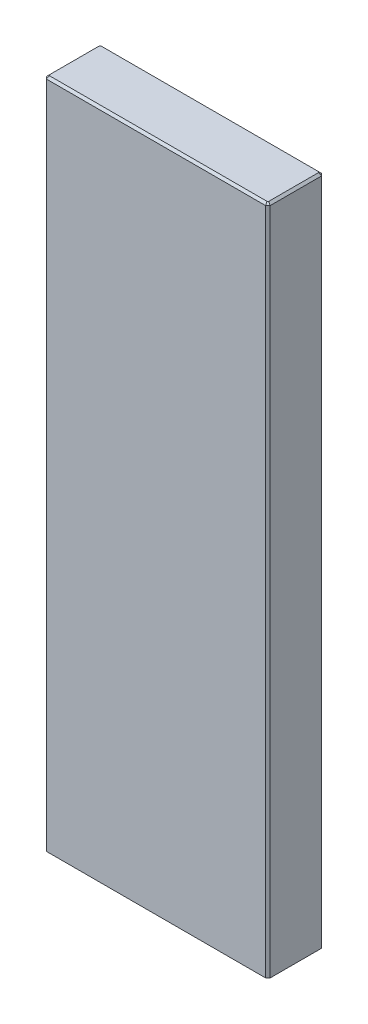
ISO-10303-21;
HEADER;
FILE_DESCRIPTION(('STEP AP214'),'2;1');
FILE_NAME('part.step','',(''),(''),'','','');
FILE_SCHEMA(('AUTOMOTIVE_DESIGN { 1 0 10303 214 1 1 1 1 }'));
ENDSEC;
DATA;
#1=APPLICATION_CONTEXT('core data for automotive mechanical design processes');
#2=APPLICATION_PROTOCOL_DEFINITION('international standard','automotive_design',2000,#1);
#3=PRODUCT_CONTEXT('',#1,'mechanical');
#4=PRODUCT('Part','Part','',(#3));
#5=PRODUCT_RELATED_PRODUCT_CATEGORY('part','',(#4));
#6=PRODUCT_DEFINITION_FORMATION('','',#4);
#7=PRODUCT_DEFINITION_CONTEXT('part definition',#1,'design');
#8=PRODUCT_DEFINITION('design','',#6,#7);
#9=PRODUCT_DEFINITION_SHAPE('','',#8);
#10=(LENGTH_UNIT() NAMED_UNIT(*) SI_UNIT(.MILLI.,.METRE.));
#11=(NAMED_UNIT(*) PLANE_ANGLE_UNIT() SI_UNIT($,.RADIAN.));
#12=(NAMED_UNIT(*) SI_UNIT($,.STERADIAN.) SOLID_ANGLE_UNIT());
#13=UNCERTAINTY_MEASURE_WITH_UNIT(LENGTH_MEASURE(1.E-05),#10,'distance_accuracy_value','');
#14=(GEOMETRIC_REPRESENTATION_CONTEXT(3) GLOBAL_UNCERTAINTY_ASSIGNED_CONTEXT((#13)) GLOBAL_UNIT_ASSIGNED_CONTEXT((#10,
#11,#12)) REPRESENTATION_CONTEXT('',''));
#15=CARTESIAN_POINT('',(0.,0.,0.));
#16=DIRECTION('',(0.,0.,1.));
#17=DIRECTION('',(1.,0.,0.));
#18=AXIS2_PLACEMENT_3D('',#15,#16,#17);
#19=CARTESIAN_POINT('',(-25.4,152.4,12.7));
#20=DIRECTION('',(1.,0.,0.));
#21=DIRECTION('',(0.,1.,0.));
#22=AXIS2_PLACEMENT_3D('',#19,#20,#21);
#23=PLANE('',#22);
#24=DIRECTION('',(0.,1.,0.));
#25=VECTOR('',#24,1.);
#26=CARTESIAN_POINT('',(-25.4,152.4,12.2));
#27=LINE('',#26,#25);
#28=CARTESIAN_POINT('',(-25.4,0.,12.2));
#29=VERTEX_POINT('',#28);
#30=CARTESIAN_POINT('',(-25.4,151.9,12.2));
#31=VERTEX_POINT('',#30);
#32=EDGE_CURVE('E173',#29,#31,#27,.T.);
#33=ORIENTED_EDGE('',*,*,#32,.T.);
#34=DIRECTION('',(0.,0.,-1.));
#35=VECTOR('',#34,1.);
#36=CARTESIAN_POINT('',(-25.4,151.9,12.7));
#37=LINE('',#36,#35);
#38=CARTESIAN_POINT('',(-25.4,151.9,0.5));
#39=VERTEX_POINT('',#38);
#40=EDGE_CURVE('E202',#31,#39,#37,.T.);
#41=ORIENTED_EDGE('',*,*,#40,.T.);
#42=DIRECTION('',(0.,-1.,0.));
#43=VECTOR('',#42,1.);
#44=CARTESIAN_POINT('',(-25.4,152.4,0.5));
#45=LINE('',#44,#43);
#46=CARTESIAN_POINT('',(-25.4,0.,0.500000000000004));
#47=VERTEX_POINT('',#46);
#48=EDGE_CURVE('E176',#39,#47,#45,.T.);
#49=ORIENTED_EDGE('',*,*,#48,.T.);
#50=DIRECTION('',(0.,0.,-1.));
#51=VECTOR('',#50,1.);
#52=CARTESIAN_POINT('',(-25.4,0.,12.7));
#53=LINE('',#52,#51);
#54=EDGE_CURVE('E149',#29,#47,#53,.T.);
#55=ORIENTED_EDGE('',*,*,#54,.F.);
#56=EDGE_LOOP('',(#33,#41,#49,#55));
#57=FACE_BOUND('',#56,.T.);
#58=ADVANCED_FACE('F31',(#57),#23,.F.);
#59=CARTESIAN_POINT('',(-25.4,0.,12.7));
#60=DIRECTION('',(0.,1.,0.));
#61=DIRECTION('',(0.,0.,1.));
#62=AXIS2_PLACEMENT_3D('',#59,#60,#61);
#63=PLANE('',#62);
#64=CARTESIAN_POINT('',(14.0875,0.,6.35));
#65=DIRECTION('',(0.,-1.,0.));
#66=DIRECTION('',(0.,0.,-1.));
#67=AXIS2_PLACEMENT_3D('',#64,#65,#66);
#68=CIRCLE('',#67,3.048);
#69=CARTESIAN_POINT('',(14.0875,0.,3.302));
#70=VERTEX_POINT('',#69);
#71=EDGE_CURVE('E229',#70,#70,#68,.T.);
#72=ORIENTED_EDGE('',*,*,#71,.F.);
#73=EDGE_LOOP('',(#72));
#74=FACE_BOUND('',#73,.T.);
#75=DIRECTION('',(1.,0.,0.));
#76=VECTOR('',#75,1.);
#77=CARTESIAN_POINT('',(-25.4,0.,0.));
#78=LINE('',#77,#76);
#79=CARTESIAN_POINT('',(-24.9,0.,0.));
#80=VERTEX_POINT('',#79);
#81=CARTESIAN_POINT('',(24.9,0.,0.));
#82=VERTEX_POINT('',#81);
#83=EDGE_CURVE('E133',#80,#82,#78,.T.);
#84=ORIENTED_EDGE('',*,*,#83,.T.);
#85=DIRECTION('',(-0.707106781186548,0.,-0.707106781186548));
#86=VECTOR('',#85,1.);
#87=CARTESIAN_POINT('',(25.4,0.,0.499999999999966));
#88=LINE('',#87,#86);
#89=CARTESIAN_POINT('',(25.4,0.,0.499999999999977));
#90=VERTEX_POINT('',#89);
#91=EDGE_CURVE('E166',#82,#90,#88,.F.);
#92=ORIENTED_EDGE('',*,*,#91,.T.);
#93=DIRECTION('',(0.,0.,-1.));
#94=VECTOR('',#93,1.);
#95=CARTESIAN_POINT('',(25.4,0.,12.7));
#96=LINE('',#95,#94);
#97=CARTESIAN_POINT('',(25.4,0.,12.2));
#98=VERTEX_POINT('',#97);
#99=EDGE_CURVE('E145',#98,#90,#96,.T.);
#100=ORIENTED_EDGE('',*,*,#99,.F.);
#101=DIRECTION('',(-0.707106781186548,0.,0.707106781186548));
#102=VECTOR('',#101,1.);
#103=CARTESIAN_POINT('',(24.9,0.,12.7));
#104=LINE('',#103,#102);
#105=CARTESIAN_POINT('',(24.9,0.,12.7));
#106=VERTEX_POINT('',#105);
#107=EDGE_CURVE('E164',#98,#106,#104,.T.);
#108=ORIENTED_EDGE('',*,*,#107,.T.);
#109=DIRECTION('',(1.,0.,0.));
#110=VECTOR('',#109,1.);
#111=CARTESIAN_POINT('',(-25.4,0.,12.7));
#112=LINE('',#111,#110);
#113=CARTESIAN_POINT('',(-24.9,0.,12.7));
#114=VERTEX_POINT('',#113);
#115=EDGE_CURVE('E137',#114,#106,#112,.T.);
#116=ORIENTED_EDGE('',*,*,#115,.F.);
#117=DIRECTION('',(-0.707106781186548,0.,-0.707106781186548));
#118=VECTOR('',#117,1.);
#119=CARTESIAN_POINT('',(-24.9,0.,12.7));
#120=LINE('',#119,#118);
#121=EDGE_CURVE('E160',#114,#29,#120,.T.);
#122=ORIENTED_EDGE('',*,*,#121,.T.);
#123=ORIENTED_EDGE('',*,*,#54,.T.);
#124=DIRECTION('',(-0.707106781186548,0.,0.707106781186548));
#125=VECTOR('',#124,1.);
#126=CARTESIAN_POINT('',(-25.4,0.,0.499999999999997));
#127=LINE('',#126,#125);
#128=EDGE_CURVE('E162',#47,#80,#127,.F.);
#129=ORIENTED_EDGE('',*,*,#128,.T.);
#130=EDGE_LOOP('',(#84,#92,#100,#108,#116,#122,#123,#129));
#131=FACE_BOUND('',#130,.T.);
#132=ADVANCED_FACE('F263',(#74,#131),#63,.F.);
#133=CARTESIAN_POINT('',(25.4,152.4,12.7));
#134=DIRECTION('',(-1.,0.,0.));
#135=DIRECTION('',(0.,-1.,0.));
#136=AXIS2_PLACEMENT_3D('',#133,#134,#135);
#137=PLANE('',#136);
#138=DIRECTION('',(0.,1.,0.));
#139=VECTOR('',#138,1.);
#140=CARTESIAN_POINT('',(25.4,152.4,0.499999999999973));
#141=LINE('',#140,#139);
#142=CARTESIAN_POINT('',(25.4,151.9,0.499999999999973));
#143=VERTEX_POINT('',#142);
#144=EDGE_CURVE('E154',#90,#143,#141,.T.);
#145=ORIENTED_EDGE('',*,*,#144,.T.);
#146=DIRECTION('',(0.,0.,1.));
#147=VECTOR('',#146,1.);
#148=CARTESIAN_POINT('',(25.4,151.9,12.7));
#149=LINE('',#148,#147);
#150=CARTESIAN_POINT('',(25.4,151.9,12.2));
#151=VERTEX_POINT('',#150);
#152=EDGE_CURVE('E11',#143,#151,#149,.T.);
#153=ORIENTED_EDGE('',*,*,#152,.T.);
#154=DIRECTION('',(0.,-1.,0.));
#155=VECTOR('',#154,1.);
#156=CARTESIAN_POINT('',(25.4,0.,12.2));
#157=LINE('',#156,#155);
#158=EDGE_CURVE('E152',#151,#98,#157,.T.);
#159=ORIENTED_EDGE('',*,*,#158,.T.);
#160=ORIENTED_EDGE('',*,*,#99,.T.);
#161=EDGE_LOOP('',(#145,#153,#159,#160));
#162=FACE_BOUND('',#161,.T.);
#163=ADVANCED_FACE('F271',(#162),#137,.F.);
#164=CARTESIAN_POINT('',(-25.4,152.4,12.7));
#165=DIRECTION('',(0.,-1.,0.));
#166=DIRECTION('',(1.,0.,0.));
#167=AXIS2_PLACEMENT_3D('',#164,#165,#166);
#168=PLANE('',#167);
#169=DIRECTION('',(1.,0.,0.));
#170=VECTOR('',#169,1.);
#171=CARTESIAN_POINT('',(24.9,152.4,12.2));
#172=LINE('',#171,#170);
#173=CARTESIAN_POINT('',(-24.6928932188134,152.4,12.2));
#174=VERTEX_POINT('',#173);
#175=CARTESIAN_POINT('',(24.6928932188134,152.4,12.2));
#176=VERTEX_POINT('',#175);
#177=EDGE_CURVE('E190',#174,#176,#172,.T.);
#178=ORIENTED_EDGE('',*,*,#177,.T.);
#179=DIRECTION('',(0.707106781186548,0.,-0.707106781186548));
#180=VECTOR('',#179,1.);
#181=CARTESIAN_POINT('',(25.0464466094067,152.4,11.8464466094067));
#182=LINE('',#181,#180);
#183=CARTESIAN_POINT('',(24.9,152.4,11.9928932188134));
#184=VERTEX_POINT('',#183);
#185=EDGE_CURVE('E192',#176,#184,#182,.T.);
#186=ORIENTED_EDGE('',*,*,#185,.T.);
#187=DIRECTION('',(0.,0.,-1.));
#188=VECTOR('',#187,1.);
#189=CARTESIAN_POINT('',(24.9,152.4,12.7));
#190=LINE('',#189,#188);
#191=CARTESIAN_POINT('',(24.9,152.4,0.707106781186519));
#192=VERTEX_POINT('',#191);
#193=EDGE_CURVE('E178',#184,#192,#190,.T.);
#194=ORIENTED_EDGE('',*,*,#193,.T.);
#195=DIRECTION('',(-0.707106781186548,0.,-0.707106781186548));
#196=VECTOR('',#195,1.);
#197=CARTESIAN_POINT('',(24.5464466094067,152.4,0.353553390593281));
#198=LINE('',#197,#196);
#199=CARTESIAN_POINT('',(24.6928932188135,152.4,0.500000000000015));
#200=VERTEX_POINT('',#199);
#201=EDGE_CURVE('E180',#192,#200,#198,.T.);
#202=ORIENTED_EDGE('',*,*,#201,.T.);
#203=DIRECTION('',(-1.,0.,0.));
#204=VECTOR('',#203,1.);
#205=CARTESIAN_POINT('',(-25.4,152.4,0.500000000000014));
#206=LINE('',#205,#204);
#207=CARTESIAN_POINT('',(-24.6928932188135,152.4,0.500000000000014));
#208=VERTEX_POINT('',#207);
#209=EDGE_CURVE('E182',#200,#208,#206,.T.);
#210=ORIENTED_EDGE('',*,*,#209,.T.);
#211=DIRECTION('',(-0.707106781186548,0.,0.707106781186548));
#212=VECTOR('',#211,1.);
#213=CARTESIAN_POINT('',(-25.0464466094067,152.4,0.853553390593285));
#214=LINE('',#213,#212);
#215=CARTESIAN_POINT('',(-24.9,152.4,0.707106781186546));
#216=VERTEX_POINT('',#215);
#217=EDGE_CURVE('E184',#208,#216,#214,.T.);
#218=ORIENTED_EDGE('',*,*,#217,.T.);
#219=DIRECTION('',(0.,0.,1.));
#220=VECTOR('',#219,1.);
#221=CARTESIAN_POINT('',(-24.9,152.4,12.7));
#222=LINE('',#221,#220);
#223=CARTESIAN_POINT('',(-24.9,152.4,11.9928932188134));
#224=VERTEX_POINT('',#223);
#225=EDGE_CURVE('E186',#216,#224,#222,.T.);
#226=ORIENTED_EDGE('',*,*,#225,.T.);
#227=DIRECTION('',(0.707106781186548,0.,0.707106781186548));
#228=VECTOR('',#227,1.);
#229=CARTESIAN_POINT('',(-24.5464466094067,152.4,12.3464466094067));
#230=LINE('',#229,#228);
#231=EDGE_CURVE('E188',#224,#174,#230,.T.);
#232=ORIENTED_EDGE('',*,*,#231,.T.);
#233=EDGE_LOOP('',(#178,#186,#194,#202,#210,#218,#226,#232));
#234=FACE_BOUND('',#233,.T.);
#235=ADVANCED_FACE('F358',(#234),#168,.F.);
#236=CARTESIAN_POINT('',(-25.4,0.,12.7));
#237=DIRECTION('',(0.,0.,1.));
#238=DIRECTION('',(1.,0.,0.));
#239=AXIS2_PLACEMENT_3D('',#236,#237,#238);
#240=PLANE('',#239);
#241=DIRECTION('',(0.,1.,0.));
#242=VECTOR('',#241,1.);
#243=CARTESIAN_POINT('',(24.9,152.4,12.7));
#244=LINE('',#243,#242);
#245=CARTESIAN_POINT('',(24.9,151.9,12.7));
#246=VERTEX_POINT('',#245);
#247=EDGE_CURVE('E170',#106,#246,#244,.T.);
#248=ORIENTED_EDGE('',*,*,#247,.T.);
#249=DIRECTION('',(-1.,0.,0.));
#250=VECTOR('',#249,1.);
#251=CARTESIAN_POINT('',(-24.9,151.9,12.7));
#252=LINE('',#251,#250);
#253=CARTESIAN_POINT('',(-24.9,151.9,12.7));
#254=VERTEX_POINT('',#253);
#255=EDGE_CURVE('E198',#246,#254,#252,.T.);
#256=ORIENTED_EDGE('',*,*,#255,.T.);
#257=DIRECTION('',(0.,-1.,0.));
#258=VECTOR('',#257,1.);
#259=CARTESIAN_POINT('',(-24.9,0.,12.7));
#260=LINE('',#259,#258);
#261=EDGE_CURVE('E168',#254,#114,#260,.T.);
#262=ORIENTED_EDGE('',*,*,#261,.T.);
#263=ORIENTED_EDGE('',*,*,#115,.T.);
#264=EDGE_LOOP('',(#248,#256,#262,#263));
#265=FACE_BOUND('',#264,.T.);
#266=ADVANCED_FACE('F339',(#265),#240,.T.);
#267=CARTESIAN_POINT('',(-25.4,0.,0.));
#268=DIRECTION('',(0.,0.,1.));
#269=DIRECTION('',(1.,0.,0.));
#270=AXIS2_PLACEMENT_3D('',#267,#268,#269);
#271=PLANE('',#270);
#272=DIRECTION('',(0.,1.,0.));
#273=VECTOR('',#272,1.);
#274=CARTESIAN_POINT('',(-24.9,0.,0.));
#275=LINE('',#274,#273);
#276=CARTESIAN_POINT('',(-24.9,151.9,0.));
#277=VERTEX_POINT('',#276);
#278=EDGE_CURVE('E156',#80,#277,#275,.T.);
#279=ORIENTED_EDGE('',*,*,#278,.T.);
#280=DIRECTION('',(1.,0.,0.));
#281=VECTOR('',#280,1.);
#282=CARTESIAN_POINT('',(-25.4000000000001,151.9,0.));
#283=LINE('',#282,#281);
#284=CARTESIAN_POINT('',(24.9,151.9,0.));
#285=VERTEX_POINT('',#284);
#286=EDGE_CURVE('E55',#277,#285,#283,.T.);
#287=ORIENTED_EDGE('',*,*,#286,.T.);
#288=DIRECTION('',(0.,-1.,0.));
#289=VECTOR('',#288,1.);
#290=CARTESIAN_POINT('',(24.9,0.,0.));
#291=LINE('',#290,#289);
#292=EDGE_CURVE('E158',#285,#82,#291,.T.);
#293=ORIENTED_EDGE('',*,*,#292,.T.);
#294=ORIENTED_EDGE('',*,*,#83,.F.);
#295=EDGE_LOOP('',(#279,#287,#293,#294));
#296=FACE_BOUND('',#295,.T.);
#297=ADVANCED_FACE('F127',(#296),#271,.F.);
#298=CARTESIAN_POINT('',(14.0875,27.78,6.35));
#299=DIRECTION('',(0.,-1.,0.));
#300=DIRECTION('',(0.,0.,-1.));
#301=AXIS2_PLACEMENT_3D('',#298,#299,#300);
#302=CONICAL_SURFACE('',#301,2.01929999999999,1.02974425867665);
#303=CARTESIAN_POINT('',(14.0875,28.9933178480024,6.35));
#304=VERTEX_POINT('',#303);
#305=VERTEX_LOOP('',#304);
#306=FACE_BOUND('',#305,.T.);
#307=CARTESIAN_POINT('',(14.0875,27.78,6.35));
#308=DIRECTION('',(0.,-1.,0.));
#309=DIRECTION('',(0.,0.,-1.));
#310=AXIS2_PLACEMENT_3D('',#307,#308,#309);
#311=CIRCLE('',#310,2.01929999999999);
#312=CARTESIAN_POINT('',(14.0875,27.78,4.33070000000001));
#313=VERTEX_POINT('',#312);
#314=EDGE_CURVE('E131',#313,#313,#311,.T.);
#315=ORIENTED_EDGE('',*,*,#314,.T.);
#316=EDGE_LOOP('',(#315));
#317=FACE_BOUND('',#316,.T.);
#318=ADVANCED_FACE('F123',(#306,#317),#302,.F.);
#319=CARTESIAN_POINT('',(14.0875,0.,6.35));
#320=DIRECTION('',(0.,-1.,0.));
#321=DIRECTION('',(0.,0.,-1.));
#322=AXIS2_PLACEMENT_3D('',#319,#320,#321);
#323=CYLINDRICAL_SURFACE('',#322,2.01929999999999);
#324=ORIENTED_EDGE('',*,*,#314,.F.);
#325=EDGE_LOOP('',(#324));
#326=FACE_BOUND('',#325,.T.);
#327=CARTESIAN_POINT('',(14.0875,25.4,6.35));
#328=DIRECTION('',(0.,-1.,0.));
#329=DIRECTION('',(0.,0.,-1.));
#330=AXIS2_PLACEMENT_3D('',#327,#328,#329);
#331=CIRCLE('',#330,2.01929999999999);
#332=CARTESIAN_POINT('',(14.0875,25.4,4.33070000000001));
#333=VERTEX_POINT('',#332);
#334=EDGE_CURVE('E134',#333,#333,#331,.T.);
#335=ORIENTED_EDGE('',*,*,#334,.T.);
#336=EDGE_LOOP('',(#335));
#337=FACE_BOUND('',#336,.T.);
#338=ADVANCED_FACE('F126',(#326,#337),#323,.F.);
#339=CARTESIAN_POINT('',(16.1068,25.4,6.35));
#340=DIRECTION('',(0.,1.,0.));
#341=DIRECTION('',(0.,0.,1.));
#342=AXIS2_PLACEMENT_3D('',#339,#340,#341);
#343=PLANE('',#342);
#344=ORIENTED_EDGE('',*,*,#334,.F.);
#345=EDGE_LOOP('',(#344));
#346=FACE_BOUND('',#345,.T.);
#347=CARTESIAN_POINT('',(14.0875,25.4,6.35));
#348=DIRECTION('',(0.,-1.,0.));
#349=DIRECTION('',(0.,0.,-1.));
#350=AXIS2_PLACEMENT_3D('',#347,#348,#349);
#351=CIRCLE('',#350,2.41299999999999);
#352=CARTESIAN_POINT('',(14.0875,25.4,3.93700000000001));
#353=VERTEX_POINT('',#352);
#354=EDGE_CURVE('E140',#353,#353,#351,.T.);
#355=ORIENTED_EDGE('',*,*,#354,.T.);
#356=EDGE_LOOP('',(#355));
#357=FACE_BOUND('',#356,.T.);
#358=ADVANCED_FACE('F244',(#346,#357),#343,.F.);
#359=CARTESIAN_POINT('',(14.0875,0.,6.35));
#360=DIRECTION('',(0.,-1.,0.));
#361=DIRECTION('',(0.,0.,-1.));
#362=AXIS2_PLACEMENT_3D('',#359,#360,#361);
#363=CYLINDRICAL_SURFACE('',#362,2.413);
#364=ORIENTED_EDGE('',*,*,#354,.F.);
#365=EDGE_LOOP('',(#364));
#366=FACE_BOUND('',#365,.T.);
#367=CARTESIAN_POINT('',(14.0875,0.634999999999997,6.35));
#368=DIRECTION('',(0.,-1.,0.));
#369=DIRECTION('',(0.,0.,-1.));
#370=AXIS2_PLACEMENT_3D('',#367,#368,#369);
#371=CIRCLE('',#370,2.413);
#372=CARTESIAN_POINT('',(14.0875,0.634999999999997,3.937));
#373=VERTEX_POINT('',#372);
#374=EDGE_CURVE('E235',#373,#373,#371,.T.);
#375=ORIENTED_EDGE('',*,*,#374,.T.);
#376=EDGE_LOOP('',(#375));
#377=FACE_BOUND('',#376,.T.);
#378=ADVANCED_FACE('F246',(#366,#377),#363,.F.);
#379=CARTESIAN_POINT('',(14.0875,0.,6.35));
#380=DIRECTION('',(0.,-1.,0.));
#381=DIRECTION('',(0.,0.,-1.));
#382=AXIS2_PLACEMENT_3D('',#379,#380,#381);
#383=CONICAL_SURFACE('',#382,3.048,0.785398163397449);
#384=ORIENTED_EDGE('',*,*,#374,.F.);
#385=EDGE_LOOP('',(#384));
#386=FACE_BOUND('',#385,.T.);
#387=ORIENTED_EDGE('',*,*,#71,.T.);
#388=EDGE_LOOP('',(#387));
#389=FACE_BOUND('',#388,.T.);
#390=ADVANCED_FACE('F249',(#386,#389),#383,.F.);
#391=CARTESIAN_POINT('',(25.4,152.4,0.499999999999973));
#392=DIRECTION('',(-0.707106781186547,0.,0.707106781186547));
#393=DIRECTION('',(0.707106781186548,0.,0.707106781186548));
#394=AXIS2_PLACEMENT_3D('',#391,#392,#393);
#395=PLANE('',#394);
#396=ORIENTED_EDGE('',*,*,#292,.F.);
#397=DIRECTION('',(-0.707106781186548,0.,-0.707106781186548));
#398=VECTOR('',#397,1.);
#399=CARTESIAN_POINT('',(25.4,151.9,0.499999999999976));
#400=LINE('',#399,#398);
#401=EDGE_CURVE('E40',#285,#143,#400,.F.);
#402=ORIENTED_EDGE('',*,*,#401,.T.);
#403=ORIENTED_EDGE('',*,*,#144,.F.);
#404=ORIENTED_EDGE('',*,*,#91,.F.);
#405=EDGE_LOOP('',(#396,#402,#403,#404));
#406=FACE_BOUND('',#405,.T.);
#407=ADVANCED_FACE('F254',(#406),#395,.F.);
#408=CARTESIAN_POINT('',(24.9,0.,12.7));
#409=DIRECTION('',(0.707106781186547,0.,0.707106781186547));
#410=DIRECTION('',(0.707106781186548,0.,-0.707106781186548));
#411=AXIS2_PLACEMENT_3D('',#408,#409,#410);
#412=PLANE('',#411);
#413=ORIENTED_EDGE('',*,*,#158,.F.);
#414=DIRECTION('',(-0.707106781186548,0.,0.707106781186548));
#415=VECTOR('',#414,1.);
#416=CARTESIAN_POINT('',(24.9,151.9,12.7));
#417=LINE('',#416,#415);
#418=EDGE_CURVE('E195',#151,#246,#417,.T.);
#419=ORIENTED_EDGE('',*,*,#418,.T.);
#420=ORIENTED_EDGE('',*,*,#247,.F.);
#421=ORIENTED_EDGE('',*,*,#107,.F.);
#422=EDGE_LOOP('',(#413,#419,#420,#421));
#423=FACE_BOUND('',#422,.T.);
#424=ADVANCED_FACE('F260',(#423),#412,.T.);
#425=CARTESIAN_POINT('',(-25.4,152.4,0.5));
#426=DIRECTION('',(0.707106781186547,0.,0.707106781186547));
#427=DIRECTION('',(0.707106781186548,0.,-0.707106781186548));
#428=AXIS2_PLACEMENT_3D('',#425,#426,#427);
#429=PLANE('',#428);
#430=ORIENTED_EDGE('',*,*,#48,.F.);
#431=DIRECTION('',(-0.707106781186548,0.,0.707106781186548));
#432=VECTOR('',#431,1.);
#433=CARTESIAN_POINT('',(-24.9,151.9,0.));
#434=LINE('',#433,#432);
#435=EDGE_CURVE('E204',#39,#277,#434,.F.);
#436=ORIENTED_EDGE('',*,*,#435,.T.);
#437=ORIENTED_EDGE('',*,*,#278,.F.);
#438=ORIENTED_EDGE('',*,*,#128,.F.);
#439=EDGE_LOOP('',(#430,#436,#437,#438));
#440=FACE_BOUND('',#439,.T.);
#441=ADVANCED_FACE('F278',(#440),#429,.F.);
#442=CARTESIAN_POINT('',(-24.9,0.,12.7));
#443=DIRECTION('',(-0.707106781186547,0.,0.707106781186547));
#444=DIRECTION('',(0.707106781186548,0.,0.707106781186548));
#445=AXIS2_PLACEMENT_3D('',#442,#443,#444);
#446=PLANE('',#445);
#447=ORIENTED_EDGE('',*,*,#261,.F.);
#448=DIRECTION('',(-0.707106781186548,0.,-0.707106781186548));
#449=VECTOR('',#448,1.);
#450=CARTESIAN_POINT('',(-25.4,151.9,12.2));
#451=LINE('',#450,#449);
#452=EDGE_CURVE('E200',#254,#31,#451,.T.);
#453=ORIENTED_EDGE('',*,*,#452,.T.);
#454=ORIENTED_EDGE('',*,*,#32,.F.);
#455=ORIENTED_EDGE('',*,*,#121,.F.);
#456=EDGE_LOOP('',(#447,#453,#454,#455));
#457=FACE_BOUND('',#456,.T.);
#458=ADVANCED_FACE('F282',(#457),#446,.T.);
#459=CARTESIAN_POINT('',(-31.1464466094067,152.4,6.95355339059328));
#460=DIRECTION('',(0.50000000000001,-0.707106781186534,0.50000000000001));
#461=DIRECTION('',(0.816496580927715,0.577350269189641,0.));
#462=AXIS2_PLACEMENT_3D('',#459,#460,#461);
#463=PLANE('',#462);
#464=DIRECTION('',(0.281084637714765,0.678598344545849,0.678598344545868));
#465=VECTOR('',#464,1.);
#466=CARTESIAN_POINT('',(-24.7487607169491,152.265123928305,0.365123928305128));
#467=LINE('',#466,#465);
#468=EDGE_CURVE('E223',#277,#208,#467,.T.);
#469=ORIENTED_EDGE('',*,*,#468,.F.);
#470=ORIENTED_EDGE('',*,*,#435,.F.);
#471=DIRECTION('',(0.678598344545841,0.678598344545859,0.281084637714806));
#472=VECTOR('',#471,1.);
#473=CARTESIAN_POINT('',(-26.5849923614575,150.715007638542,0.00916009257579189));
#474=LINE('',#473,#472);
#475=EDGE_CURVE('E35',#216,#39,#474,.F.);
#476=ORIENTED_EDGE('',*,*,#475,.F.);
#477=ORIENTED_EDGE('',*,*,#217,.F.);
#478=EDGE_LOOP('',(#469,#470,#476,#477));
#479=FACE_BOUND('',#478,.T.);
#480=ADVANCED_FACE('F33',(#479),#463,.F.);
#481=CARTESIAN_POINT('',(-25.4,151.9,12.7));
#482=DIRECTION('',(0.707106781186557,-0.707106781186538,0.));
#483=DIRECTION('',(0.707106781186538,0.707106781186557,0.));
#484=AXIS2_PLACEMENT_3D('',#481,#482,#483);
#485=PLANE('',#484);
#486=ORIENTED_EDGE('',*,*,#475,.T.);
#487=ORIENTED_EDGE('',*,*,#40,.F.);
#488=DIRECTION('',(-0.678598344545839,-0.678598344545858,0.281084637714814));
#489=VECTOR('',#488,1.);
#490=CARTESIAN_POINT('',(-25.4953717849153,151.804628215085,12.2395042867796));
#491=LINE('',#490,#489);
#492=EDGE_CURVE('E221',#224,#31,#491,.T.);
#493=ORIENTED_EDGE('',*,*,#492,.F.);
#494=ORIENTED_EDGE('',*,*,#225,.F.);
#495=EDGE_LOOP('',(#486,#487,#493,#494));
#496=FACE_BOUND('',#495,.T.);
#497=ADVANCED_FACE('F309',(#496),#485,.F.);
#498=CARTESIAN_POINT('',(-25.4,152.4,0.500000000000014));
#499=DIRECTION('',(0.,-0.707106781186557,0.707106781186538));
#500=DIRECTION('',(0.,-0.707106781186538,-0.707106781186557));
#501=AXIS2_PLACEMENT_3D('',#498,#499,#500);
#502=PLANE('',#501);
#503=ORIENTED_EDGE('',*,*,#468,.T.);
#504=ORIENTED_EDGE('',*,*,#209,.F.);
#505=DIRECTION('',(-0.281084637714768,0.678598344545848,0.678598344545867));
#506=VECTOR('',#505,1.);
#507=CARTESIAN_POINT('',(26.8098743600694,147.289155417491,-4.61084458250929));
#508=LINE('',#507,#506);
#509=EDGE_CURVE('E218',#285,#200,#508,.T.);
#510=ORIENTED_EDGE('',*,*,#509,.F.);
#511=ORIENTED_EDGE('',*,*,#286,.F.);
#512=EDGE_LOOP('',(#503,#504,#510,#511));
#513=FACE_BOUND('',#512,.T.);
#514=ADVANCED_FACE('F306',(#513),#502,.F.);
#515=CARTESIAN_POINT('',(-24.7964466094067,152.4,12.0964466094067));
#516=DIRECTION('',(-0.500000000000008,0.707106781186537,0.500000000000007));
#517=DIRECTION('',(-0.816496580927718,-0.577350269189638,0.));
#518=AXIS2_PLACEMENT_3D('',#515,#516,#517);
#519=PLANE('',#518);
#520=ORIENTED_EDGE('',*,*,#492,.T.);
#521=ORIENTED_EDGE('',*,*,#452,.F.);
#522=DIRECTION('',(0.281084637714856,0.678598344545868,-0.678598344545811));
#523=VECTOR('',#522,1.);
#524=CARTESIAN_POINT('',(-24.6813226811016,152.427933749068,12.1720662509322));
#525=LINE('',#524,#523);
#526=EDGE_CURVE('E215',#174,#254,#525,.F.);
#527=ORIENTED_EDGE('',*,*,#526,.F.);
#528=ORIENTED_EDGE('',*,*,#231,.F.);
#529=EDGE_LOOP('',(#520,#521,#527,#528));
#530=FACE_BOUND('',#529,.T.);
#531=ADVANCED_FACE('F302',(#530),#519,.T.);
#532=CARTESIAN_POINT('',(5.74644660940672,152.4,-18.4464466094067));
#533=DIRECTION('',(-0.500000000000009,-0.707106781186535,0.500000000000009));
#534=DIRECTION('',(0.,-0.577350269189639,-0.816496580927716));
#535=AXIS2_PLACEMENT_3D('',#532,#533,#534);
#536=PLANE('',#535);
#537=ORIENTED_EDGE('',*,*,#509,.T.);
#538=ORIENTED_EDGE('',*,*,#201,.F.);
#539=DIRECTION('',(-0.67859834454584,0.678598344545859,0.281084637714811));
#540=VECTOR('',#539,1.);
#541=CARTESIAN_POINT('',(22.6124327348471,154.687567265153,1.65464816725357));
#542=LINE('',#541,#540);
#543=EDGE_CURVE('E212',#143,#192,#542,.T.);
#544=ORIENTED_EDGE('',*,*,#543,.F.);
#545=ORIENTED_EDGE('',*,*,#401,.F.);
#546=EDGE_LOOP('',(#537,#538,#544,#545));
#547=FACE_BOUND('',#546,.T.);
#548=ADVANCED_FACE('F298',(#547),#536,.F.);
#549=CARTESIAN_POINT('',(-25.4000000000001,151.9,12.7));
#550=DIRECTION('',(0.,0.707106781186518,0.707106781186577));
#551=DIRECTION('',(0.,-0.707106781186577,0.707106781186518));
#552=AXIS2_PLACEMENT_3D('',#549,#550,#551);
#553=PLANE('',#552);
#554=ORIENTED_EDGE('',*,*,#526,.T.);
#555=ORIENTED_EDGE('',*,*,#255,.F.);
#556=DIRECTION('',(-0.281084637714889,0.678598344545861,-0.678598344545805));
#557=VECTOR('',#556,1.);
#558=CARTESIAN_POINT('',(20.9258687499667,161.494401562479,3.10559843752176));
#559=LINE('',#558,#557);
#560=EDGE_CURVE('E210',#176,#246,#559,.F.);
#561=ORIENTED_EDGE('',*,*,#560,.F.);
#562=ORIENTED_EDGE('',*,*,#177,.F.);
#563=EDGE_LOOP('',(#554,#555,#561,#562));
#564=FACE_BOUND('',#563,.T.);
#565=ADVANCED_FACE('F294',(#564),#553,.T.);
#566=CARTESIAN_POINT('',(24.9,152.4,12.7));
#567=DIRECTION('',(-0.707106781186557,-0.707106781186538,0.));
#568=DIRECTION('',(0.707106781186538,-0.707106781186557,0.));
#569=AXIS2_PLACEMENT_3D('',#566,#567,#568);
#570=PLANE('',#569);
#571=ORIENTED_EDGE('',*,*,#543,.T.);
#572=ORIENTED_EDGE('',*,*,#193,.F.);
#573=DIRECTION('',(-0.678598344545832,0.678598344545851,-0.281084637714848));
#574=VECTOR('',#573,1.);
#575=CARTESIAN_POINT('',(25.0348760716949,152.265123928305,12.0487607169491));
#576=LINE('',#575,#574);
#577=EDGE_CURVE('E208',#151,#184,#576,.T.);
#578=ORIENTED_EDGE('',*,*,#577,.F.);
#579=ORIENTED_EDGE('',*,*,#152,.F.);
#580=EDGE_LOOP('',(#571,#572,#578,#579));
#581=FACE_BOUND('',#580,.T.);
#582=ADVANCED_FACE('F290',(#581),#570,.F.);
#583=CARTESIAN_POINT('',(-0.60355339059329,152.4,37.4964466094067));
#584=DIRECTION('',(0.499999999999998,0.70710678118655,0.499999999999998));
#585=DIRECTION('',(0.,-0.577350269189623,0.816496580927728));
#586=AXIS2_PLACEMENT_3D('',#583,#584,#585);
#587=PLANE('',#586);
#588=ORIENTED_EDGE('',*,*,#560,.T.);
#589=ORIENTED_EDGE('',*,*,#418,.F.);
#590=ORIENTED_EDGE('',*,*,#577,.T.);
#591=ORIENTED_EDGE('',*,*,#185,.F.);
#592=EDGE_LOOP('',(#588,#589,#590,#591));
#593=FACE_BOUND('',#592,.T.);
#594=ADVANCED_FACE('F287',(#593),#587,.T.);
#595=CLOSED_SHELL('',(#58,#132,#163,#235,#266,#297,#318,#338,#358,#378,#390,#407,#424,#441,#458,
#480,#497,#514,#531,#548,#565,#582,#594));
#596=MANIFOLD_SOLID_BREP('B2',#595);
#597=ADVANCED_BREP_SHAPE_REPRESENTATION('',(#18,#596),#14);
#598=SHAPE_DEFINITION_REPRESENTATION(#9,#597);
ENDSEC;
END-ISO-10303-21;
